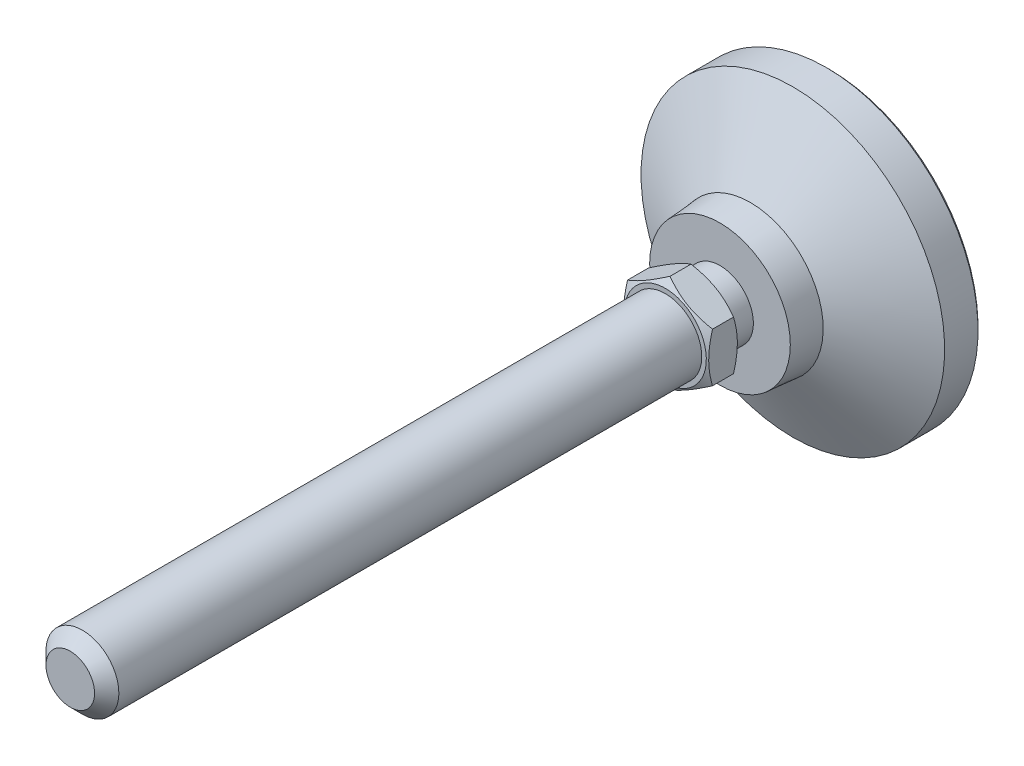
ISO-10303-21;
HEADER;
FILE_DESCRIPTION(('STEP AP214'),'2;1');
FILE_NAME('part.step','',(''),(''),'','','');
FILE_SCHEMA(('AUTOMOTIVE_DESIGN { 1 0 10303 214 1 1 1 1 }'));
ENDSEC;
DATA;
#1=APPLICATION_CONTEXT('core data for automotive mechanical design processes');
#2=APPLICATION_PROTOCOL_DEFINITION('international standard','automotive_design',2000,#1);
#3=PRODUCT_CONTEXT('',#1,'mechanical');
#4=PRODUCT('Part','Part','',(#3));
#5=PRODUCT_RELATED_PRODUCT_CATEGORY('part','',(#4));
#6=PRODUCT_DEFINITION_FORMATION('','',#4);
#7=PRODUCT_DEFINITION_CONTEXT('part definition',#1,'design');
#8=PRODUCT_DEFINITION('design','',#6,#7);
#9=PRODUCT_DEFINITION_SHAPE('','',#8);
#10=(LENGTH_UNIT() NAMED_UNIT(*) SI_UNIT(.MILLI.,.METRE.));
#11=(NAMED_UNIT(*) PLANE_ANGLE_UNIT() SI_UNIT($,.RADIAN.));
#12=(NAMED_UNIT(*) SI_UNIT($,.STERADIAN.) SOLID_ANGLE_UNIT());
#13=UNCERTAINTY_MEASURE_WITH_UNIT(LENGTH_MEASURE(1.E-05),#10,'distance_accuracy_value','');
#14=(GEOMETRIC_REPRESENTATION_CONTEXT(3) GLOBAL_UNCERTAINTY_ASSIGNED_CONTEXT((#13)) GLOBAL_UNIT_ASSIGNED_CONTEXT((#10,
#11,#12)) REPRESENTATION_CONTEXT('',''));
#15=CARTESIAN_POINT('',(0.,0.,0.));
#16=DIRECTION('',(0.,0.,1.));
#17=DIRECTION('',(1.,0.,0.));
#18=AXIS2_PLACEMENT_3D('',#15,#16,#17);
#19=CARTESIAN_POINT('',(0.,0.,-1.00000000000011));
#20=DIRECTION('',(0.,0.,-1.));
#21=DIRECTION('',(0.,1.,0.));
#22=AXIS2_PLACEMENT_3D('',#19,#20,#21);
#23=CYLINDRICAL_SURFACE('',#22,5.5);
#24=CARTESIAN_POINT('',(0.,0.,21.9999999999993));
#25=DIRECTION('',(0.,0.,-1.));
#26=DIRECTION('',(0.,1.,0.));
#27=AXIS2_PLACEMENT_3D('',#24,#25,#26);
#28=CIRCLE('',#27,5.5);
#29=CARTESIAN_POINT('',(0.,5.5,21.9999999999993));
#30=VERTEX_POINT('',#29);
#31=EDGE_CURVE('E100',#30,#30,#28,.T.);
#32=ORIENTED_EDGE('',*,*,#31,.T.);
#33=EDGE_LOOP('',(#32));
#34=FACE_BOUND('',#33,.T.);
#35=CARTESIAN_POINT('',(0.,0.,18.));
#36=DIRECTION('',(0.,0.,-1.));
#37=DIRECTION('',(0.,1.,0.));
#38=AXIS2_PLACEMENT_3D('',#35,#36,#37);
#39=CIRCLE('',#38,5.5);
#40=CARTESIAN_POINT('',(0.,5.5,18.));
#41=VERTEX_POINT('',#40);
#42=EDGE_CURVE('E93',#41,#41,#39,.T.);
#43=ORIENTED_EDGE('',*,*,#42,.F.);
#44=EDGE_LOOP('',(#43));
#45=FACE_BOUND('',#44,.T.);
#46=ADVANCED_FACE('F14',(#34,#45),#23,.T.);
#47=CARTESIAN_POINT('',(-5.5,0.,21.9999999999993));
#48=DIRECTION('',(0.,0.,1.));
#49=DIRECTION('',(0.,-1.,0.));
#50=AXIS2_PLACEMENT_3D('',#47,#48,#49);
#51=PLANE('',#50);
#52=CARTESIAN_POINT('',(0.,0.,21.9999999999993));
#53=DIRECTION('',(0.,0.,1.));
#54=DIRECTION('',(0.,-1.,0.));
#55=AXIS2_PLACEMENT_3D('',#52,#53,#54);
#56=CIRCLE('',#55,6.75);
#57=CARTESIAN_POINT('',(0.,-6.75,21.9999999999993));
#58=VERTEX_POINT('',#57);
#59=EDGE_CURVE('E417',#58,#58,#56,.T.);
#60=ORIENTED_EDGE('',*,*,#59,.F.);
#61=EDGE_LOOP('',(#60));
#62=FACE_BOUND('',#61,.T.);
#63=ORIENTED_EDGE('',*,*,#31,.F.);
#64=EDGE_LOOP('',(#63));
#65=FACE_BOUND('',#64,.T.);
#66=ADVANCED_FACE('F133',(#62,#65),#51,.F.);
#67=CARTESIAN_POINT('',(0.,-5.5,18.));
#68=DIRECTION('',(0.,0.,1.));
#69=DIRECTION('',(0.,-1.,0.));
#70=AXIS2_PLACEMENT_3D('',#67,#68,#69);
#71=PLANE('',#70);
#72=ORIENTED_EDGE('',*,*,#42,.T.);
#73=EDGE_LOOP('',(#72));
#74=FACE_BOUND('',#73,.T.);
#75=CARTESIAN_POINT('',(0.,0.,18.));
#76=DIRECTION('',(0.,0.,1.));
#77=DIRECTION('',(0.,-1.,0.));
#78=AXIS2_PLACEMENT_3D('',#75,#76,#77);
#79=CIRCLE('',#78,11.5833333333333);
#80=CARTESIAN_POINT('',(0.,-11.5833333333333,18.));
#81=VERTEX_POINT('',#80);
#82=EDGE_CURVE('E88',#81,#81,#79,.T.);
#83=ORIENTED_EDGE('',*,*,#82,.T.);
#84=EDGE_LOOP('',(#83));
#85=FACE_BOUND('',#84,.T.);
#86=ADVANCED_FACE('F124',(#74,#85),#71,.T.);
#87=CARTESIAN_POINT('',(0.,0.,0.));
#88=DIRECTION('',(0.,0.,-1.));
#89=DIRECTION('',(0.,1.,0.));
#90=AXIS2_PLACEMENT_3D('',#87,#88,#89);
#91=PLANE('',#90);
#92=CARTESIAN_POINT('',(0.,0.,0.));
#93=DIRECTION('',(0.,0.,-1.));
#94=DIRECTION('',(0.,1.,0.));
#95=AXIS2_PLACEMENT_3D('',#92,#93,#94);
#96=CIRCLE('',#95,24.5);
#97=CARTESIAN_POINT('',(0.,24.5,0.));
#98=VERTEX_POINT('',#97);
#99=EDGE_CURVE('E108',#98,#98,#96,.T.);
#100=ORIENTED_EDGE('',*,*,#99,.T.);
#101=EDGE_LOOP('',(#100));
#102=FACE_BOUND('',#101,.T.);
#103=ADVANCED_FACE('F122',(#102),#91,.T.);
#104=CARTESIAN_POINT('',(0.,0.,-1.00000000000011));
#105=DIRECTION('',(0.,0.,-1.));
#106=DIRECTION('',(0.,1.,0.));
#107=AXIS2_PLACEMENT_3D('',#104,#105,#106);
#108=CYLINDRICAL_SURFACE('',#107,25.);
#109=CARTESIAN_POINT('',(0.,0.,0.500000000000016));
#110=DIRECTION('',(0.,0.,-1.));
#111=DIRECTION('',(0.,1.,0.));
#112=AXIS2_PLACEMENT_3D('',#109,#110,#111);
#113=CIRCLE('',#112,25.);
#114=CARTESIAN_POINT('',(0.,25.,0.500000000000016));
#115=VERTEX_POINT('',#114);
#116=EDGE_CURVE('E28',#115,#115,#113,.F.);
#117=ORIENTED_EDGE('',*,*,#116,.T.);
#118=EDGE_LOOP('',(#117));
#119=FACE_BOUND('',#118,.T.);
#120=CARTESIAN_POINT('',(0.,0.,6.));
#121=DIRECTION('',(0.,0.,-1.));
#122=DIRECTION('',(0.,1.,0.));
#123=AXIS2_PLACEMENT_3D('',#120,#121,#122);
#124=CIRCLE('',#123,25.);
#125=CARTESIAN_POINT('',(0.,25.,6.));
#126=VERTEX_POINT('',#125);
#127=EDGE_CURVE('E106',#126,#126,#124,.T.);
#128=ORIENTED_EDGE('',*,*,#127,.T.);
#129=EDGE_LOOP('',(#128));
#130=FACE_BOUND('',#129,.T.);
#131=ADVANCED_FACE('F114',(#119,#130),#108,.T.);
#132=CARTESIAN_POINT('',(0.,0.,13.));
#133=DIRECTION('',(0.,0.,-1.));
#134=DIRECTION('',(0.,1.,0.));
#135=AXIS2_PLACEMENT_3D('',#132,#133,#134);
#136=CONICAL_SURFACE('',#135,11.9999999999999,1.07685495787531);
#137=ORIENTED_EDGE('',*,*,#127,.F.);
#138=EDGE_LOOP('',(#137));
#139=FACE_BOUND('',#138,.T.);
#140=CARTESIAN_POINT('',(0.,0.,13.));
#141=DIRECTION('',(0.,0.,-1.));
#142=DIRECTION('',(0.,1.,0.));
#143=AXIS2_PLACEMENT_3D('',#140,#141,#142);
#144=CIRCLE('',#143,11.9999999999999);
#145=CARTESIAN_POINT('',(0.,11.9999999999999,13.));
#146=VERTEX_POINT('',#145);
#147=EDGE_CURVE('E103',#146,#146,#144,.T.);
#148=ORIENTED_EDGE('',*,*,#147,.T.);
#149=EDGE_LOOP('',(#148));
#150=FACE_BOUND('',#149,.T.);
#151=ADVANCED_FACE('F132',(#139,#150),#136,.T.);
#152=CARTESIAN_POINT('',(0.,0.,19.));
#153=DIRECTION('',(0.,0.,-1.));
#154=DIRECTION('',(0.,1.,0.));
#155=AXIS2_PLACEMENT_3D('',#152,#153,#154);
#156=CONICAL_SURFACE('',#155,11.5,0.0831412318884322);
#157=ORIENTED_EDGE('',*,*,#147,.F.);
#158=EDGE_LOOP('',(#157));
#159=FACE_BOUND('',#158,.T.);
#160=ORIENTED_EDGE('',*,*,#82,.F.);
#161=EDGE_LOOP('',(#160));
#162=FACE_BOUND('',#161,.T.);
#163=ADVANCED_FACE('F119',(#159,#162),#156,.T.);
#164=CARTESIAN_POINT('',(0.,0.,0.));
#165=DIRECTION('',(0.,0.,1.));
#166=DIRECTION('',(0.,-1.,0.));
#167=AXIS2_PLACEMENT_3D('',#164,#165,#166);
#168=CONICAL_SURFACE('',#167,24.5,0.785398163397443);
#169=ORIENTED_EDGE('',*,*,#116,.F.);
#170=EDGE_LOOP('',(#169));
#171=FACE_BOUND('',#170,.T.);
#172=ORIENTED_EDGE('',*,*,#99,.F.);
#173=EDGE_LOOP('',(#172));
#174=FACE_BOUND('',#173,.T.);
#175=ADVANCED_FACE('F16',(#171,#174),#168,.T.);
#176=CARTESIAN_POINT('',(0.,0.,21.9999999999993));
#177=DIRECTION('',(0.,0.,1.));
#178=DIRECTION('',(0.,-1.,0.));
#179=AXIS2_PLACEMENT_3D('',#176,#177,#178);
#180=CONICAL_SURFACE('',#179,6.75,1.0471975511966);
#181=CARTESIAN_POINT('',(0.000200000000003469,-8.0830192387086,22.7696190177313));
#182=CARTESIAN_POINT('',(-0.15366790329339,-7.99418356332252,22.7183374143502));
#183=CARTESIAN_POINT('',(-0.308109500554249,-7.90501666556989,22.6693831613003));
#184=CARTESIAN_POINT('',(-0.618246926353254,-7.72595873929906,22.5767703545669));
#185=CARTESIAN_POINT('',(-0.773943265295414,-7.63606741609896,22.5331140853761));
#186=CARTESIAN_POINT('',(-1.24352516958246,-7.36495417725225,22.4109491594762));
#187=CARTESIAN_POINT('',(-1.5592643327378,-7.18266208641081,22.3414631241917));
#188=CARTESIAN_POINT('',(-2.03176224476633,-6.90986528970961,22.2599825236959));
#189=CARTESIAN_POINT('',(-2.18710922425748,-6.82017566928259,22.2367710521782));
#190=CARTESIAN_POINT('',(-2.49850511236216,-6.64039116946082,22.1978487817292));
#191=CARTESIAN_POINT('',(-2.6545539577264,-6.55029632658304,22.1821373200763));
#192=CARTESIAN_POINT('',(-2.96692267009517,-6.36995016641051,22.1586154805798));
#193=CARTESIAN_POINT('',(-3.12324202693,-6.27969914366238,22.1507961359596));
#194=CARTESIAN_POINT('',(-3.43601650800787,-6.09911871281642,22.1432178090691));
#195=CARTESIAN_POINT('',(-3.59247162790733,-6.00878930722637,22.1434585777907));
#196=CARTESIAN_POINT('',(-4.02110687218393,-5.76131663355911,22.1551972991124));
#197=CARTESIAN_POINT('',(-4.29314668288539,-5.60425437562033,22.1749033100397));
#198=CARTESIAN_POINT('',(-4.83541944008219,-5.29117305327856,22.2373910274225));
#199=CARTESIAN_POINT('',(-5.10565047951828,-5.13515508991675,22.2801940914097));
#200=CARTESIAN_POINT('',(-5.64901454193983,-4.82144370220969,22.3871892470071));
#201=CARTESIAN_POINT('',(-5.92207900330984,-4.6637898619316,22.4518346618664));
#202=CARTESIAN_POINT('',(-6.46413578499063,-4.35083323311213,22.5985536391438));
#203=CARTESIAN_POINT('',(-6.73313504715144,-4.19552643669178,22.6805927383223));
#204=CARTESIAN_POINT('',(-7.0002,-4.04133641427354,22.7696190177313));
#205=B_SPLINE_CURVE_WITH_KNOTS('',3,(#181,#182,#183,#184,#185,#186,#187,#188,#189,#190,#191,
#192,#193,#194,#195,#196,#197,#198,#199,#200,#201,#202,#203,#204),.UNSPECIFIED.,.F.,.F.,(4,2,2,
2,2,2,2,2,2,2,2,4),(0.,0.554727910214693,1.10969417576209,2.2219327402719,2.76443041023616,
3.30688013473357,3.84871284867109,4.39052882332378,5.33376515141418,6.27787517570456,
7.2429241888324,8.20607866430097),.UNSPECIFIED.);
#206=CARTESIAN_POINT('',(0.,-8.08290376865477,22.769552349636));
#207=VERTEX_POINT('',#206);
#208=CARTESIAN_POINT('',(-7.,-4.04145188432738,22.769552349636));
#209=VERTEX_POINT('',#208);
#210=EDGE_CURVE('E73',#207,#209,#205,.T.);
#211=ORIENTED_EDGE('',*,*,#210,.T.);
#212=CARTESIAN_POINT('',(-7.,10.8843135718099,25.5743487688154));
#213=CARTESIAN_POINT('',(-7.,10.5783368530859,25.4258083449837));
#214=CARTESIAN_POINT('',(-7.,10.2716608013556,25.2786839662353));
#215=CARTESIAN_POINT('',(-7.,9.65653822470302,24.9880631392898));
#216=CARTESIAN_POINT('',(-7.,9.34809143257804,24.8445672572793));
#217=CARTESIAN_POINT('',(-7.,8.72748000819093,24.561283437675));
#218=CARTESIAN_POINT('',(-7.,8.41530429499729,24.4215196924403));
#219=CARTESIAN_POINT('',(-7.,7.78847993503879,24.1476738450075));
#220=CARTESIAN_POINT('',(-7.,7.47383140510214,24.0135914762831));
#221=CARTESIAN_POINT('',(-7.,6.83129639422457,23.7483705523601));
#222=CARTESIAN_POINT('',(-7.,6.50331166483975,23.6174687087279));
#223=CARTESIAN_POINT('',(-7.,5.8435163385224,23.3655033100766));
#224=CARTESIAN_POINT('',(-7.,5.51170531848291,23.2444408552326));
#225=CARTESIAN_POINT('',(-7.,4.84433738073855,23.0153118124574));
#226=CARTESIAN_POINT('',(-7.,4.50878950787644,22.9072191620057));
#227=CARTESIAN_POINT('',(-7.,3.83289244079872,22.7074780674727));
#228=CARTESIAN_POINT('',(-7.,3.49254478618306,22.6158244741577));
#229=CARTESIAN_POINT('',(-7.,2.80869285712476,22.453835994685));
#230=CARTESIAN_POINT('',(-7.,2.46521697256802,22.3833844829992));
#231=CARTESIAN_POINT('',(-7.,1.9468522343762,22.2966442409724));
#232=CARTESIAN_POINT('',(-7.,1.77352613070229,22.2708858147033));
#233=CARTESIAN_POINT('',(-7.,1.42600353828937,22.2261860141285));
#234=CARTESIAN_POINT('',(-7.,1.25180713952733,22.2072439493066));
#235=CARTESIAN_POINT('',(-7.,0.905064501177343,22.1767931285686));
#236=CARTESIAN_POINT('',(-7.,0.732526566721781,22.165190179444));
#237=CARTESIAN_POINT('',(-7.,0.387114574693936,22.149292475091));
#238=CARTESIAN_POINT('',(-7.,0.214240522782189,22.1449975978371));
#239=CARTESIAN_POINT('',(-7.,-0.131534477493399,22.1438185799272));
#240=CARTESIAN_POINT('',(-7.,-0.304435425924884,22.1469344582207));
#241=CARTESIAN_POINT('',(-7.,-0.649951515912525,22.160500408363));
#242=CARTESIAN_POINT('',(-7.,-0.822566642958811,22.1709508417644));
#243=CARTESIAN_POINT('',(-7.,-1.23654690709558,22.2045874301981));
#244=CARTESIAN_POINT('',(-7.,-1.47763916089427,22.2312054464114));
#245=CARTESIAN_POINT('',(-7.,-1.95804167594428,22.2973039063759));
#246=CARTESIAN_POINT('',(-7.,-2.19735169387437,22.3367860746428));
#247=CARTESIAN_POINT('',(-7.,-2.91233041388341,22.4724359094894));
#248=CARTESIAN_POINT('',(-7.,-3.38478335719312,22.5857825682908));
#249=CARTESIAN_POINT('',(-7.,-4.09127056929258,22.7824373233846));
#250=CARTESIAN_POINT('',(-7.,-4.32896651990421,22.8533481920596));
#251=CARTESIAN_POINT('',(-7.,-4.80204998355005,23.0025606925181));
#252=CARTESIAN_POINT('',(-7.,-5.0374374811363,23.080862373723));
#253=CARTESIAN_POINT('',(-7.,-5.50597763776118,23.2435980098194));
#254=CARTESIAN_POINT('',(-7.,-5.73913099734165,23.3280299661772));
#255=CARTESIAN_POINT('',(-7.,-6.20350413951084,23.5020301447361));
#256=CARTESIAN_POINT('',(-7.,-6.43472394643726,23.5915983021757));
#257=CARTESIAN_POINT('',(-7.,-6.98705353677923,23.8114891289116));
#258=CARTESIAN_POINT('',(-7.,-7.30734827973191,23.9438554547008));
#259=CARTESIAN_POINT('',(-7.,-7.94515802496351,24.2151434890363));
#260=CARTESIAN_POINT('',(-7.,-8.26267284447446,24.3540656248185));
#261=CARTESIAN_POINT('',(-7.,-8.8954514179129,24.6371301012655));
#262=CARTESIAN_POINT('',(-7.,-9.2107146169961,24.7812736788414));
#263=CARTESIAN_POINT('',(-7.,-9.839297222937,25.0737095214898));
#264=CARTESIAN_POINT('',(-7.,-10.1526166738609,25.2220016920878));
#265=CARTESIAN_POINT('',(-7.,-10.7779976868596,25.5221168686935));
#266=CARTESIAN_POINT('',(-7.,-11.0900574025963,25.6739437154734));
#267=CARTESIAN_POINT('',(-7.,-11.7128200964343,25.9803574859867));
#268=CARTESIAN_POINT('',(-7.,-12.0235230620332,26.1349444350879));
#269=CARTESIAN_POINT('',(-7.,-12.9538381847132,26.6020567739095));
#270=CARTESIAN_POINT('',(-7.,-13.5717456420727,26.9179767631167));
#271=CARTESIAN_POINT('',(-7.,-14.7513150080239,27.5287296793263));
#272=CARTESIAN_POINT('',(-7.,-15.3132476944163,27.8230420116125));
#273=CARTESIAN_POINT('',(-7.,-16.4350354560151,28.4156479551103));
#274=CARTESIAN_POINT('',(-7.,-16.9948904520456,28.7139417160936));
#275=CARTESIAN_POINT('',(-7.,-18.1115346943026,29.3127759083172));
#276=CARTESIAN_POINT('',(-7.,-18.6683281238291,29.613308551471));
#277=CARTESIAN_POINT('',(-7.,-19.7805907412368,30.21673960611));
#278=CARTESIAN_POINT('',(-7.,-20.3360600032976,30.5196378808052));
#279=CARTESIAN_POINT('',(-7.,-20.8910440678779,30.8234166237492));
#280=B_SPLINE_CURVE_WITH_KNOTS('',3,(#212,#213,#214,#215,#216,#217,#218,#219,#220,#221,#222,
#223,#224,#225,#226,#227,#228,#229,#230,#231,#232,#233,#234,#235,#236,#237,#238,#239,#240,#241,
#242,#243,#244,#245,#246,#247,#248,#249,#250,#251,#252,#253,#254,#255,#256,#257,#258,#259,#260,
#261,#262,#263,#264,#265,#266,#267,#268,#269,#270,#271,#272,#273,#274,#275,#276,#277,#278,#279),
.UNSPECIFIED.,.F.,.F.,(4,2,2,2,2,2,2,2,2,2,2,2,2,2,2,2,2,2,2,2,2,2,2,2,2,2,2,2,2,2,2,2,2,4),(0.,
1.02039170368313,2.04094165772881,3.06699969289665,4.09300953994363,5.15231303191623,
6.21173480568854,7.26899071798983,8.32591488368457,9.37691428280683,9.90249034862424,
10.4280131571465,10.9466465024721,11.4652711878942,11.9838971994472,12.502548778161,
13.2298100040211,13.9571687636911,15.4126793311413,16.1567601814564,16.9008460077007,
17.6446903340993,18.3885252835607,19.4281306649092,20.4678038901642,21.5077250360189,
22.547622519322,23.5887082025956,24.6298034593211,26.7116971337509,28.6147022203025,
30.5177790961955,32.4159429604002,34.3139978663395),.UNSPECIFIED.);
#281=CARTESIAN_POINT('',(-7.,4.04145188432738,22.769552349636));
#282=VERTEX_POINT('',#281);
#283=EDGE_CURVE('E81',#209,#282,#280,.F.);
#284=ORIENTED_EDGE('',*,*,#283,.T.);
#285=CARTESIAN_POINT('',(-7.0002,4.04133641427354,22.7696190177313));
#286=CARTESIAN_POINT('',(-6.84633209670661,4.13017208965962,22.7183374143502));
#287=CARTESIAN_POINT('',(-6.69189049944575,4.21933898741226,22.6693831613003));
#288=CARTESIAN_POINT('',(-6.38175307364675,4.39839691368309,22.5767703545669));
#289=CARTESIAN_POINT('',(-6.22605673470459,4.48828823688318,22.5331140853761));
#290=CARTESIAN_POINT('',(-5.75647483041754,4.75940147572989,22.4109491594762));
#291=CARTESIAN_POINT('',(-5.4407356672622,4.94169356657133,22.3414631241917));
#292=CARTESIAN_POINT('',(-4.96823775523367,5.21449036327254,22.2599825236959));
#293=CARTESIAN_POINT('',(-4.81289077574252,5.30417998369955,22.2367710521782));
#294=CARTESIAN_POINT('',(-4.50149488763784,5.48396448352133,22.1978487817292));
#295=CARTESIAN_POINT('',(-4.3454460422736,5.57405932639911,22.1821373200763));
#296=CARTESIAN_POINT('',(-4.03307732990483,5.75440548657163,22.1586154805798));
#297=CARTESIAN_POINT('',(-3.87675797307,5.84465650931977,22.1507961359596));
#298=CARTESIAN_POINT('',(-3.56398349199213,6.02523694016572,22.1432178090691));
#299=CARTESIAN_POINT('',(-3.40752837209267,6.11556634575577,22.1434585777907));
#300=CARTESIAN_POINT('',(-2.97889312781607,6.36303901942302,22.1551972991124));
#301=CARTESIAN_POINT('',(-2.70685331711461,6.52010127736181,22.1749033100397));
#302=CARTESIAN_POINT('',(-2.16458055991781,6.83318259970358,22.2373910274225));
#303=CARTESIAN_POINT('',(-1.89434952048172,6.9892005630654,22.2801940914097));
#304=CARTESIAN_POINT('',(-1.35098545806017,7.30291195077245,22.3871892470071));
#305=CARTESIAN_POINT('',(-1.07792099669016,7.46056579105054,22.4518346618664));
#306=CARTESIAN_POINT('',(-0.535864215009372,7.77352241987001,22.5985536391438));
#307=CARTESIAN_POINT('',(-0.266864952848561,7.92882921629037,22.6805927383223));
#308=CARTESIAN_POINT('',(0.00019999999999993,8.0830192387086,22.7696190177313));
#309=B_SPLINE_CURVE_WITH_KNOTS('',3,(#285,#286,#287,#288,#289,#290,#291,#292,#293,#294,#295,
#296,#297,#298,#299,#300,#301,#302,#303,#304,#305,#306,#307,#308),.UNSPECIFIED.,.F.,.F.,(4,2,2,
2,2,2,2,2,2,2,2,4),(0.,0.554727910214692,1.10969417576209,2.22193274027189,2.76443041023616,
3.30688013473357,3.84871284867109,4.39052882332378,5.33376515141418,6.27787517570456,
7.2429241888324,8.20607866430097),.UNSPECIFIED.);
#310=CARTESIAN_POINT('',(0.,8.08290376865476,22.769552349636));
#311=VERTEX_POINT('',#310);
#312=EDGE_CURVE('E361',#282,#311,#309,.T.);
#313=ORIENTED_EDGE('',*,*,#312,.T.);
#314=CARTESIAN_POINT('',(-0.000200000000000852,8.0830192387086,22.7696190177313));
#315=CARTESIAN_POINT('',(0.15366790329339,7.99418356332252,22.7183374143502));
#316=CARTESIAN_POINT('',(0.308109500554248,7.90501666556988,22.6693831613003));
#317=CARTESIAN_POINT('',(0.618246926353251,7.72595873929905,22.5767703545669));
#318=CARTESIAN_POINT('',(0.773943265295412,7.63606741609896,22.5331140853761));
#319=CARTESIAN_POINT('',(1.24352516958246,7.36495417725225,22.4109491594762));
#320=CARTESIAN_POINT('',(1.5592643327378,7.18266208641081,22.3414631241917));
#321=CARTESIAN_POINT('',(2.03176224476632,6.9098652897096,22.2599825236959));
#322=CARTESIAN_POINT('',(2.18710922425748,6.82017566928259,22.2367710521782));
#323=CARTESIAN_POINT('',(2.49850511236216,6.64039116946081,22.1978487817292));
#324=CARTESIAN_POINT('',(2.6545539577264,6.55029632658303,22.1821373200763));
#325=CARTESIAN_POINT('',(2.96692267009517,6.36995016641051,22.1586154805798));
#326=CARTESIAN_POINT('',(3.12324202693,6.27969914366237,22.1507961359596));
#327=CARTESIAN_POINT('',(3.43601650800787,6.09911871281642,22.1432178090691));
#328=CARTESIAN_POINT('',(3.59247162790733,6.00878930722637,22.1434585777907));
#329=CARTESIAN_POINT('',(4.02110687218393,5.76131663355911,22.1551972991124));
#330=CARTESIAN_POINT('',(4.29314668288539,5.60425437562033,22.1749033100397));
#331=CARTESIAN_POINT('',(4.83541944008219,5.29117305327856,22.2373910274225));
#332=CARTESIAN_POINT('',(5.10565047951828,5.13515508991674,22.2801940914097));
#333=CARTESIAN_POINT('',(5.64901454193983,4.82144370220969,22.3871892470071));
#334=CARTESIAN_POINT('',(5.92207900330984,4.66378986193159,22.4518346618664));
#335=CARTESIAN_POINT('',(6.46413578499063,4.35083323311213,22.5985536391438));
#336=CARTESIAN_POINT('',(6.73313504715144,4.19552643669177,22.6805927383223));
#337=CARTESIAN_POINT('',(7.0002,4.04133641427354,22.7696190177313));
#338=B_SPLINE_CURVE_WITH_KNOTS('',3,(#314,#315,#316,#317,#318,#319,#320,#321,#322,#323,#324,
#325,#326,#327,#328,#329,#330,#331,#332,#333,#334,#335,#336,#337),.UNSPECIFIED.,.F.,.F.,(4,2,2,
2,2,2,2,2,2,2,2,4),(0.,0.554727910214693,1.10969417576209,2.2219327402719,2.76443041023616,
3.30688013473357,3.84871284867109,4.39052882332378,5.33376515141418,6.27787517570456,
7.2429241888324,8.20607866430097),.UNSPECIFIED.);
#339=CARTESIAN_POINT('',(7.,4.04145188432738,22.769552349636));
#340=VERTEX_POINT('',#339);
#341=EDGE_CURVE('E356',#311,#340,#338,.T.);
#342=ORIENTED_EDGE('',*,*,#341,.T.);
#343=CARTESIAN_POINT('',(7.,10.8843135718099,25.5743487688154));
#344=CARTESIAN_POINT('',(7.,10.5783368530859,25.4258083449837));
#345=CARTESIAN_POINT('',(7.,10.2716608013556,25.2786839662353));
#346=CARTESIAN_POINT('',(7.,9.65653822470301,24.9880631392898));
#347=CARTESIAN_POINT('',(7.,9.34809143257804,24.8445672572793));
#348=CARTESIAN_POINT('',(7.,8.72748000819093,24.561283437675));
#349=CARTESIAN_POINT('',(7.,8.41530429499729,24.4215196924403));
#350=CARTESIAN_POINT('',(7.,7.78847993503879,24.1476738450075));
#351=CARTESIAN_POINT('',(7.,7.47383140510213,24.0135914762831));
#352=CARTESIAN_POINT('',(7.,6.83129639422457,23.7483705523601));
#353=CARTESIAN_POINT('',(7.,6.50331166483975,23.6174687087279));
#354=CARTESIAN_POINT('',(7.,5.8435163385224,23.3655033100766));
#355=CARTESIAN_POINT('',(7.,5.51170531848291,23.2444408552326));
#356=CARTESIAN_POINT('',(7.,4.84433738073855,23.0153118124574));
#357=CARTESIAN_POINT('',(7.,4.50878950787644,22.9072191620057));
#358=CARTESIAN_POINT('',(7.,3.83289244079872,22.7074780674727));
#359=CARTESIAN_POINT('',(7.,3.49254478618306,22.6158244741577));
#360=CARTESIAN_POINT('',(7.,2.80869285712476,22.453835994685));
#361=CARTESIAN_POINT('',(7.,2.46521697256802,22.3833844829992));
#362=CARTESIAN_POINT('',(7.,1.9468522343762,22.2966442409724));
#363=CARTESIAN_POINT('',(7.,1.77352613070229,22.2708858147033));
#364=CARTESIAN_POINT('',(7.,1.42600353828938,22.2261860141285));
#365=CARTESIAN_POINT('',(7.,1.25180713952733,22.2072439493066));
#366=CARTESIAN_POINT('',(7.,0.905064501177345,22.1767931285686));
#367=CARTESIAN_POINT('',(7.,0.732526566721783,22.165190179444));
#368=CARTESIAN_POINT('',(7.,0.387114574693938,22.149292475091));
#369=CARTESIAN_POINT('',(7.,0.214240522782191,22.1449975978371));
#370=CARTESIAN_POINT('',(7.,-0.131534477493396,22.1438185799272));
#371=CARTESIAN_POINT('',(7.,-0.30443542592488,22.1469344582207));
#372=CARTESIAN_POINT('',(7.,-0.649951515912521,22.160500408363));
#373=CARTESIAN_POINT('',(7.,-0.822566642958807,22.1709508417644));
#374=CARTESIAN_POINT('',(7.,-1.23654690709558,22.2045874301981));
#375=CARTESIAN_POINT('',(7.,-1.47763916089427,22.2312054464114));
#376=CARTESIAN_POINT('',(7.,-1.95804167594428,22.2973039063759));
#377=CARTESIAN_POINT('',(7.,-2.19735169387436,22.3367860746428));
#378=CARTESIAN_POINT('',(7.,-2.91233041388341,22.4724359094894));
#379=CARTESIAN_POINT('',(7.,-3.38478335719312,22.5857825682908));
#380=CARTESIAN_POINT('',(7.,-4.09127056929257,22.7824373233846));
#381=CARTESIAN_POINT('',(7.,-4.3289665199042,22.8533481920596));
#382=CARTESIAN_POINT('',(7.,-4.80204998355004,23.0025606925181));
#383=CARTESIAN_POINT('',(7.,-5.03743748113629,23.080862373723));
#384=CARTESIAN_POINT('',(7.,-5.50597763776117,23.2435980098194));
#385=CARTESIAN_POINT('',(7.,-5.73913099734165,23.3280299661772));
#386=CARTESIAN_POINT('',(7.,-6.20350413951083,23.5020301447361));
#387=CARTESIAN_POINT('',(7.,-6.43472394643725,23.5915983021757));
#388=CARTESIAN_POINT('',(7.,-6.98705353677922,23.8114891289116));
#389=CARTESIAN_POINT('',(7.,-7.3073482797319,23.9438554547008));
#390=CARTESIAN_POINT('',(7.,-7.9451580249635,24.2151434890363));
#391=CARTESIAN_POINT('',(7.,-8.26267284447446,24.3540656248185));
#392=CARTESIAN_POINT('',(7.,-8.89545141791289,24.6371301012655));
#393=CARTESIAN_POINT('',(7.,-9.21071461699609,24.7812736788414));
#394=CARTESIAN_POINT('',(7.,-9.83929722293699,25.0737095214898));
#395=CARTESIAN_POINT('',(7.,-10.1526166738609,25.2220016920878));
#396=CARTESIAN_POINT('',(7.,-10.7779976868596,25.5221168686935));
#397=CARTESIAN_POINT('',(7.,-11.0900574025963,25.6739437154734));
#398=CARTESIAN_POINT('',(7.,-11.7128200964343,25.9803574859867));
#399=CARTESIAN_POINT('',(7.,-12.0235230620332,26.1349444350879));
#400=CARTESIAN_POINT('',(7.,-12.9538381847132,26.6020567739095));
#401=CARTESIAN_POINT('',(7.,-13.5717456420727,26.9179767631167));
#402=CARTESIAN_POINT('',(7.,-14.7513150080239,27.5287296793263));
#403=CARTESIAN_POINT('',(7.,-15.3132476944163,27.8230420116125));
#404=CARTESIAN_POINT('',(7.,-16.4350354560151,28.4156479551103));
#405=CARTESIAN_POINT('',(7.,-16.9948904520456,28.7139417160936));
#406=CARTESIAN_POINT('',(7.,-18.1115346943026,29.3127759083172));
#407=CARTESIAN_POINT('',(7.,-18.6683281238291,29.613308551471));
#408=CARTESIAN_POINT('',(7.,-19.7805907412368,30.21673960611));
#409=CARTESIAN_POINT('',(7.,-20.3360600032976,30.5196378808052));
#410=CARTESIAN_POINT('',(7.,-20.8910440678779,30.8234166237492));
#411=B_SPLINE_CURVE_WITH_KNOTS('',3,(#343,#344,#345,#346,#347,#348,#349,#350,#351,#352,#353,
#354,#355,#356,#357,#358,#359,#360,#361,#362,#363,#364,#365,#366,#367,#368,#369,#370,#371,#372,
#373,#374,#375,#376,#377,#378,#379,#380,#381,#382,#383,#384,#385,#386,#387,#388,#389,#390,#391,
#392,#393,#394,#395,#396,#397,#398,#399,#400,#401,#402,#403,#404,#405,#406,#407,#408,#409,#410),
.UNSPECIFIED.,.F.,.F.,(4,2,2,2,2,2,2,2,2,2,2,2,2,2,2,2,2,2,2,2,2,2,2,2,2,2,2,2,2,2,2,2,2,4),(0.,
1.02039170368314,2.04094165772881,3.06699969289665,4.09300953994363,5.15231303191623,
6.21173480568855,7.26899071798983,8.32591488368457,9.37691428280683,9.90249034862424,
10.4280131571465,10.9466465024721,11.4652711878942,11.9838971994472,12.502548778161,
13.2298100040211,13.9571687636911,15.4126793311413,16.1567601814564,16.9008460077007,
17.6446903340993,18.3885252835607,19.4281306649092,20.4678038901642,21.5077250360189,
22.547622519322,23.5887082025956,24.6298034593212,26.7116971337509,28.6147022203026,
30.5177790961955,32.4159429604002,34.3139978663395),.UNSPECIFIED.);
#412=CARTESIAN_POINT('',(7.,-4.04145188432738,22.769552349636));
#413=VERTEX_POINT('',#412);
#414=EDGE_CURVE('E34',#340,#413,#411,.T.);
#415=ORIENTED_EDGE('',*,*,#414,.T.);
#416=CARTESIAN_POINT('',(7.0002,-4.04133641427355,22.7696190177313));
#417=CARTESIAN_POINT('',(6.84633209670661,-4.13017208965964,22.7183374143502));
#418=CARTESIAN_POINT('',(6.69189049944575,-4.21933898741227,22.6693831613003));
#419=CARTESIAN_POINT('',(6.38175307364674,-4.3983969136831,22.5767703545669));
#420=CARTESIAN_POINT('',(6.22605673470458,-4.4882882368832,22.5331140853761));
#421=CARTESIAN_POINT('',(5.75647483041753,-4.7594014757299,22.4109491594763));
#422=CARTESIAN_POINT('',(5.4407356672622,-4.94169356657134,22.3414631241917));
#423=CARTESIAN_POINT('',(4.96823775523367,-5.21449036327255,22.2599825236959));
#424=CARTESIAN_POINT('',(4.81289077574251,-5.30417998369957,22.2367710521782));
#425=CARTESIAN_POINT('',(4.50149488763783,-5.48396448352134,22.1978487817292));
#426=CARTESIAN_POINT('',(4.34544604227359,-5.57405932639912,22.1821373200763));
#427=CARTESIAN_POINT('',(4.03307732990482,-5.75440548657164,22.1586154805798));
#428=CARTESIAN_POINT('',(3.87675797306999,-5.84465650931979,22.1507961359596));
#429=CARTESIAN_POINT('',(3.56398349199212,-6.02523694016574,22.1432178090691));
#430=CARTESIAN_POINT('',(3.40752837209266,-6.11556634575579,22.1434585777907));
#431=CARTESIAN_POINT('',(2.97889312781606,-6.36303901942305,22.1551972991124));
#432=CARTESIAN_POINT('',(2.7068533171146,-6.52010127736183,22.1749033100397));
#433=CARTESIAN_POINT('',(2.1645805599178,-6.8331825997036,22.2373910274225));
#434=CARTESIAN_POINT('',(1.89434952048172,-6.98920056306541,22.2801940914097));
#435=CARTESIAN_POINT('',(1.35098545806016,-7.30291195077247,22.3871892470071));
#436=CARTESIAN_POINT('',(1.07792099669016,-7.46056579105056,22.4518346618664));
#437=CARTESIAN_POINT('',(0.535864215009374,-7.77352241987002,22.5985536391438));
#438=CARTESIAN_POINT('',(0.266864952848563,-7.92882921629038,22.6805927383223));
#439=CARTESIAN_POINT('',(-0.000199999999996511,-8.08301923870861,22.7696190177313));
#440=B_SPLINE_CURVE_WITH_KNOTS('',3,(#416,#417,#418,#419,#420,#421,#422,#423,#424,#425,#426,
#427,#428,#429,#430,#431,#432,#433,#434,#435,#436,#437,#438,#439),.UNSPECIFIED.,.F.,.F.,(4,2,2,
2,2,2,2,2,2,2,2,4),(0.,0.554727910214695,1.10969417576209,2.2219327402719,2.76443041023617,
3.30688013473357,3.8487128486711,4.39052882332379,5.33376515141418,6.27787517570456,
7.24292418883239,8.20607866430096),.UNSPECIFIED.);
#441=EDGE_CURVE('E9',#413,#207,#440,.T.);
#442=ORIENTED_EDGE('',*,*,#441,.T.);
#443=EDGE_LOOP('',(#211,#284,#313,#342,#415,#442));
#444=FACE_BOUND('',#443,.T.);
#445=ORIENTED_EDGE('',*,*,#59,.T.);
#446=EDGE_LOOP('',(#445));
#447=FACE_BOUND('',#446,.T.);
#448=ADVANCED_FACE('F71',(#444,#447),#180,.T.);
#449=CARTESIAN_POINT('',(0.,0.,125.));
#450=DIRECTION('',(0.,0.,-1.));
#451=DIRECTION('',(0.,1.,0.));
#452=AXIS2_PLACEMENT_3D('',#449,#450,#451);
#453=PLANE('',#452);
#454=CARTESIAN_POINT('',(0.,0.,125.));
#455=DIRECTION('',(0.,0.,-1.));
#456=DIRECTION('',(0.,1.,0.));
#457=AXIS2_PLACEMENT_3D('',#454,#455,#456);
#458=CIRCLE('',#457,3.99999999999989);
#459=CARTESIAN_POINT('',(0.,3.99999999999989,125.));
#460=VERTEX_POINT('',#459);
#461=EDGE_CURVE('E393',#460,#460,#458,.T.);
#462=ORIENTED_EDGE('',*,*,#461,.F.);
#463=EDGE_LOOP('',(#462));
#464=FACE_BOUND('',#463,.T.);
#465=ADVANCED_FACE('F187',(#464),#453,.F.);
#466=CARTESIAN_POINT('',(0.,0.,125.));
#467=DIRECTION('',(0.,0.,-1.));
#468=DIRECTION('',(0.,1.,0.));
#469=AXIS2_PLACEMENT_3D('',#466,#467,#468);
#470=CONICAL_SURFACE('',#469,3.99999999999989,0.785398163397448);
#471=CARTESIAN_POINT('',(0.,0.,123.));
#472=DIRECTION('',(0.,0.,-1.));
#473=DIRECTION('',(0.,1.,0.));
#474=AXIS2_PLACEMENT_3D('',#471,#472,#473);
#475=CIRCLE('',#474,5.99999999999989);
#476=CARTESIAN_POINT('',(0.,5.99999999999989,123.));
#477=VERTEX_POINT('',#476);
#478=EDGE_CURVE('E391',#477,#477,#475,.T.);
#479=ORIENTED_EDGE('',*,*,#478,.F.);
#480=EDGE_LOOP('',(#479));
#481=FACE_BOUND('',#480,.T.);
#482=ORIENTED_EDGE('',*,*,#461,.T.);
#483=EDGE_LOOP('',(#482));
#484=FACE_BOUND('',#483,.T.);
#485=ADVANCED_FACE('F194',(#481,#484),#470,.T.);
#486=CARTESIAN_POINT('',(0.,0.,-1.00000000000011));
#487=DIRECTION('',(0.,0.,-1.));
#488=DIRECTION('',(0.,1.,0.));
#489=AXIS2_PLACEMENT_3D('',#486,#487,#488);
#490=CYLINDRICAL_SURFACE('',#489,5.99999999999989);
#491=CARTESIAN_POINT('',(0.,0.,26.9999999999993));
#492=DIRECTION('',(0.,0.,-1.));
#493=DIRECTION('',(0.,1.,0.));
#494=AXIS2_PLACEMENT_3D('',#491,#492,#493);
#495=CIRCLE('',#494,5.99999999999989);
#496=CARTESIAN_POINT('',(0.,5.99999999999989,26.9999999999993));
#497=VERTEX_POINT('',#496);
#498=EDGE_CURVE('E97',#497,#497,#495,.T.);
#499=ORIENTED_EDGE('',*,*,#498,.F.);
#500=EDGE_LOOP('',(#499));
#501=FACE_BOUND('',#500,.T.);
#502=ORIENTED_EDGE('',*,*,#478,.T.);
#503=EDGE_LOOP('',(#502));
#504=FACE_BOUND('',#503,.T.);
#505=ADVANCED_FACE('F203',(#501,#504),#490,.T.);
#506=CARTESIAN_POINT('',(-5.99999999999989,0.,26.9999999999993));
#507=DIRECTION('',(0.,0.,-1.));
#508=DIRECTION('',(0.,1.,0.));
#509=AXIS2_PLACEMENT_3D('',#506,#507,#508);
#510=PLANE('',#509);
#511=CARTESIAN_POINT('',(0.,0.,26.9999999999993));
#512=DIRECTION('',(0.,0.,1.));
#513=DIRECTION('',(0.,-1.,0.));
#514=AXIS2_PLACEMENT_3D('',#511,#512,#513);
#515=CIRCLE('',#514,6.75);
#516=CARTESIAN_POINT('',(0.,-6.75,26.9999999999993));
#517=VERTEX_POINT('',#516);
#518=EDGE_CURVE('E80',#517,#517,#515,.T.);
#519=ORIENTED_EDGE('',*,*,#518,.T.);
#520=EDGE_LOOP('',(#519));
#521=FACE_BOUND('',#520,.T.);
#522=ORIENTED_EDGE('',*,*,#498,.T.);
#523=EDGE_LOOP('',(#522));
#524=FACE_BOUND('',#523,.T.);
#525=ADVANCED_FACE('F212',(#521,#524),#510,.F.);
#526=CARTESIAN_POINT('',(0.,0.,24.897177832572));
#527=DIRECTION('',(0.,0.,-1.));
#528=DIRECTION('',(0.,1.,0.));
#529=AXIS2_PLACEMENT_3D('',#526,#527,#528);
#530=CONICAL_SURFACE('',#529,10.3921948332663,1.0471975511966);
#531=CARTESIAN_POINT('',(-7.0002,-4.04133641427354,26.2303809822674));
#532=CARTESIAN_POINT('',(-6.84633209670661,-4.13017208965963,26.2816625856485));
#533=CARTESIAN_POINT('',(-6.69189049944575,-4.21933898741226,26.3306168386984));
#534=CARTESIAN_POINT('',(-6.38175307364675,-4.39839691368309,26.4232296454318));
#535=CARTESIAN_POINT('',(-6.22605673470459,-4.48828823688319,26.4668859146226));
#536=CARTESIAN_POINT('',(-5.75647483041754,-4.75940147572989,26.5890508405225));
#537=CARTESIAN_POINT('',(-5.4407356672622,-4.94169356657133,26.658536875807));
#538=CARTESIAN_POINT('',(-4.96823775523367,-5.21449036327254,26.7400174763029));
#539=CARTESIAN_POINT('',(-4.81289077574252,-5.30417998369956,26.7632289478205));
#540=CARTESIAN_POINT('',(-4.50149488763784,-5.48396448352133,26.8021512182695));
#541=CARTESIAN_POINT('',(-4.3454460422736,-5.57405932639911,26.8178626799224));
#542=CARTESIAN_POINT('',(-4.03307732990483,-5.75440548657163,26.8413845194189));
#543=CARTESIAN_POINT('',(-3.87675797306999,-5.84465650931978,26.8492038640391));
#544=CARTESIAN_POINT('',(-3.56398349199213,-6.02523694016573,26.8567821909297));
#545=CARTESIAN_POINT('',(-3.40752837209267,-6.11556634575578,26.856541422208));
#546=CARTESIAN_POINT('',(-2.97889312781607,-6.36303901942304,26.8448027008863));
#547=CARTESIAN_POINT('',(-2.7068533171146,-6.52010127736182,26.825096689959));
#548=CARTESIAN_POINT('',(-2.1645805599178,-6.83318259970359,26.7626089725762));
#549=CARTESIAN_POINT('',(-1.89434952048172,-6.98920056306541,26.719805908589));
#550=CARTESIAN_POINT('',(-1.35098545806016,-7.30291195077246,26.6128107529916));
#551=CARTESIAN_POINT('',(-1.07792099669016,-7.46056579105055,26.5481653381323));
#552=CARTESIAN_POINT('',(-0.535864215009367,-7.77352241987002,26.4014463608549));
#553=CARTESIAN_POINT('',(-0.266864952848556,-7.92882921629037,26.3194072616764));
#554=CARTESIAN_POINT('',(0.000200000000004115,-8.0830192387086,26.2303809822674));
#555=B_SPLINE_CURVE_WITH_KNOTS('',3,(#531,#532,#533,#534,#535,#536,#537,#538,#539,#540,#541,
#542,#543,#544,#545,#546,#547,#548,#549,#550,#551,#552,#553,#554),.UNSPECIFIED.,.F.,.F.,(4,2,2,
2,2,2,2,2,2,2,2,4),(0.,0.554727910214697,1.10969417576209,2.2219327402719,2.76443041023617,
3.30688013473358,3.8487128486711,4.3905288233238,5.33376515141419,6.27787517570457,
7.24292418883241,8.20607866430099),.UNSPECIFIED.);
#556=CARTESIAN_POINT('',(-7.,-4.04145188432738,26.2304476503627));
#557=VERTEX_POINT('',#556);
#558=CARTESIAN_POINT('',(0.,-8.08290376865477,26.2304476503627));
#559=VERTEX_POINT('',#558);
#560=EDGE_CURVE('E323',#557,#559,#555,.T.);
#561=ORIENTED_EDGE('',*,*,#560,.T.);
#562=CARTESIAN_POINT('',(-0.000199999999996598,-8.08301923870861,26.2303809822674));
#563=CARTESIAN_POINT('',(0.153667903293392,-7.99418356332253,26.2816625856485));
#564=CARTESIAN_POINT('',(0.30810950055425,-7.9050166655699,26.3306168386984));
#565=CARTESIAN_POINT('',(0.618246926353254,-7.72595873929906,26.4232296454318));
#566=CARTESIAN_POINT('',(0.773943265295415,-7.63606741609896,26.4668859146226));
#567=CARTESIAN_POINT('',(1.24352516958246,-7.36495417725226,26.5890508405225));
#568=CARTESIAN_POINT('',(1.5592643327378,-7.18266208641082,26.658536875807));
#569=CARTESIAN_POINT('',(2.03176224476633,-6.90986528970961,26.7400174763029));
#570=CARTESIAN_POINT('',(2.18710922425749,-6.8201756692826,26.7632289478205));
#571=CARTESIAN_POINT('',(2.49850511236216,-6.64039116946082,26.8021512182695));
#572=CARTESIAN_POINT('',(2.65455395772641,-6.55029632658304,26.8178626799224));
#573=CARTESIAN_POINT('',(2.96692267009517,-6.36995016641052,26.8413845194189));
#574=CARTESIAN_POINT('',(3.12324202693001,-6.27969914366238,26.8492038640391));
#575=CARTESIAN_POINT('',(3.43601650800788,-6.09911871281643,26.8567821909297));
#576=CARTESIAN_POINT('',(3.59247162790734,-6.00878930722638,26.856541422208));
#577=CARTESIAN_POINT('',(4.02110687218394,-5.76131663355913,26.8448027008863));
#578=CARTESIAN_POINT('',(4.2931466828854,-5.60425437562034,26.825096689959));
#579=CARTESIAN_POINT('',(4.8354194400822,-5.29117305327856,26.7626089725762));
#580=CARTESIAN_POINT('',(5.10565047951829,-5.13515508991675,26.719805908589));
#581=CARTESIAN_POINT('',(5.64901454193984,-4.8214437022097,26.6128107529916));
#582=CARTESIAN_POINT('',(5.92207900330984,-4.6637898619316,26.5481653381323));
#583=CARTESIAN_POINT('',(6.46413578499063,-4.35083323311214,26.4014463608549));
#584=CARTESIAN_POINT('',(6.73313504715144,-4.19552643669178,26.3194072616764));
#585=CARTESIAN_POINT('',(7.0002,-4.04133641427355,26.2303809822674));
#586=B_SPLINE_CURVE_WITH_KNOTS('',3,(#562,#563,#564,#565,#566,#567,#568,#569,#570,#571,#572,
#573,#574,#575,#576,#577,#578,#579,#580,#581,#582,#583,#584,#585),.UNSPECIFIED.,.F.,.F.,(4,2,2,
2,2,2,2,2,2,2,2,4),(0.,0.554727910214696,1.10969417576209,2.2219327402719,2.76443041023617,
3.30688013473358,3.8487128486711,4.39052882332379,5.33376515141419,6.27787517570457,
7.2429241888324,8.20607866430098),.UNSPECIFIED.);
#587=CARTESIAN_POINT('',(7.,-4.04145188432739,26.2304476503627));
#588=VERTEX_POINT('',#587);
#589=EDGE_CURVE('E86',#559,#588,#586,.T.);
#590=ORIENTED_EDGE('',*,*,#589,.T.);
#591=CARTESIAN_POINT('',(7.,10.8843135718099,23.4256512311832));
#592=CARTESIAN_POINT('',(7.,10.5783368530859,23.574191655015));
#593=CARTESIAN_POINT('',(7.,10.2716608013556,23.7213160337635));
#594=CARTESIAN_POINT('',(7.,9.65653822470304,24.011936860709));
#595=CARTESIAN_POINT('',(7.,9.34809143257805,24.1554327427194));
#596=CARTESIAN_POINT('',(7.,8.72748000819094,24.4387165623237));
#597=CARTESIAN_POINT('',(7.,8.4153042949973,24.5784803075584));
#598=CARTESIAN_POINT('',(7.,7.7884799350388,24.8523261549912));
#599=CARTESIAN_POINT('',(7.,7.47383140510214,24.9864085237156));
#600=CARTESIAN_POINT('',(7.,6.83129639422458,25.2516294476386));
#601=CARTESIAN_POINT('',(7.,6.50331166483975,25.3825312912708));
#602=CARTESIAN_POINT('',(7.,5.84351633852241,25.6344966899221));
#603=CARTESIAN_POINT('',(7.,5.51170531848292,25.7555591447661));
#604=CARTESIAN_POINT('',(7.,4.84433738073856,25.9846881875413));
#605=CARTESIAN_POINT('',(7.,4.50878950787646,26.092780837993));
#606=CARTESIAN_POINT('',(7.,3.83289244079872,26.292521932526));
#607=CARTESIAN_POINT('',(7.,3.49254478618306,26.384175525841));
#608=CARTESIAN_POINT('',(7.,2.80869285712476,26.5461640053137));
#609=CARTESIAN_POINT('',(7.,2.46521697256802,26.6166155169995));
#610=CARTESIAN_POINT('',(7.,1.9468522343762,26.7033557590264));
#611=CARTESIAN_POINT('',(7.,1.77352613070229,26.7291141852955));
#612=CARTESIAN_POINT('',(7.,1.42600353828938,26.7738139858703));
#613=CARTESIAN_POINT('',(7.,1.25180713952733,26.7927560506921));
#614=CARTESIAN_POINT('',(7.,0.90506450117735,26.8232068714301));
#615=CARTESIAN_POINT('',(7.,0.732526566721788,26.8348098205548));
#616=CARTESIAN_POINT('',(7.,0.387114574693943,26.8507075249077));
#617=CARTESIAN_POINT('',(7.,0.214240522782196,26.8550024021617));
#618=CARTESIAN_POINT('',(7.,-0.131534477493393,26.8561814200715));
#619=CARTESIAN_POINT('',(7.,-0.30443542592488,26.853065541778));
#620=CARTESIAN_POINT('',(7.,-0.649951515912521,26.8394995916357));
#621=CARTESIAN_POINT('',(7.,-0.822566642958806,26.8290491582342));
#622=CARTESIAN_POINT('',(7.,-1.23654690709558,26.7954125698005));
#623=CARTESIAN_POINT('',(7.,-1.47763916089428,26.7687945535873));
#624=CARTESIAN_POINT('',(7.,-1.9580416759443,26.7026960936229));
#625=CARTESIAN_POINT('',(7.,-2.19735169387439,26.663213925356));
#626=CARTESIAN_POINT('',(7.,-2.91233041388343,26.5275640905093));
#627=CARTESIAN_POINT('',(7.,-3.38478335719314,26.414217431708));
#628=CARTESIAN_POINT('',(7.,-4.0912705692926,26.2175626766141));
#629=CARTESIAN_POINT('',(7.,-4.32896651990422,26.1466518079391));
#630=CARTESIAN_POINT('',(7.,-4.80204998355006,25.9974393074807));
#631=CARTESIAN_POINT('',(7.,-5.03743748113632,25.9191376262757));
#632=CARTESIAN_POINT('',(7.,-5.5059776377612,25.7564019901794));
#633=CARTESIAN_POINT('',(7.,-5.73913099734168,25.6719700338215));
#634=CARTESIAN_POINT('',(7.,-6.20350413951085,25.4979698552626));
#635=CARTESIAN_POINT('',(7.,-6.43472394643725,25.408401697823));
#636=CARTESIAN_POINT('',(7.,-6.98705353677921,25.188510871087));
#637=CARTESIAN_POINT('',(7.,-7.30734827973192,25.0561445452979));
#638=CARTESIAN_POINT('',(7.,-7.94515802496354,24.7848565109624));
#639=CARTESIAN_POINT('',(7.,-8.26267284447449,24.6459343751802));
#640=CARTESIAN_POINT('',(7.,-8.89545141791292,24.3628698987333));
#641=CARTESIAN_POINT('',(7.,-9.21071461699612,24.2187263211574));
#642=CARTESIAN_POINT('',(7.,-9.83929722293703,23.9262904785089));
#643=CARTESIAN_POINT('',(7.,-10.1526166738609,23.7779983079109));
#644=CARTESIAN_POINT('',(7.,-10.7779976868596,23.4778831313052));
#645=CARTESIAN_POINT('',(7.,-11.0900574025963,23.3260562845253));
#646=CARTESIAN_POINT('',(7.,-11.7128200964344,23.0196425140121));
#647=CARTESIAN_POINT('',(7.,-12.0235230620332,22.8650555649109));
#648=CARTESIAN_POINT('',(7.,-12.9538381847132,22.3979432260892));
#649=CARTESIAN_POINT('',(7.,-13.5717456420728,22.082023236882));
#650=CARTESIAN_POINT('',(7.,-14.7513150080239,21.4712703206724));
#651=CARTESIAN_POINT('',(7.,-15.3132476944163,21.1769579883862));
#652=CARTESIAN_POINT('',(7.,-16.4350354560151,20.5843520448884));
#653=CARTESIAN_POINT('',(7.,-16.9948904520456,20.2860582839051));
#654=CARTESIAN_POINT('',(7.,-18.1115346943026,19.6872240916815));
#655=CARTESIAN_POINT('',(7.,-18.6683281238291,19.3866914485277));
#656=CARTESIAN_POINT('',(7.,-19.7805907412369,18.7832603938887));
#657=CARTESIAN_POINT('',(7.,-20.3360600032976,18.4803621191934));
#658=CARTESIAN_POINT('',(7.,-20.8910440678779,18.1765833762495));
#659=B_SPLINE_CURVE_WITH_KNOTS('',3,(#591,#592,#593,#594,#595,#596,#597,#598,#599,#600,#601,
#602,#603,#604,#605,#606,#607,#608,#609,#610,#611,#612,#613,#614,#615,#616,#617,#618,#619,#620,
#621,#622,#623,#624,#625,#626,#627,#628,#629,#630,#631,#632,#633,#634,#635,#636,#637,#638,#639,
#640,#641,#642,#643,#644,#645,#646,#647,#648,#649,#650,#651,#652,#653,#654,#655,#656,#657,#658),
.UNSPECIFIED.,.F.,.F.,(4,2,2,2,2,2,2,2,2,2,2,2,2,2,2,2,2,2,2,2,2,2,2,2,2,2,2,2,2,2,2,2,2,4),(0.,
1.02039170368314,2.04094165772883,3.06699969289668,4.09300953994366,5.15231303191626,
6.21173480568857,7.26899071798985,8.3259148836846,9.37691428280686,9.90249034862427,
10.4280131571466,10.9466465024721,11.4652711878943,11.9838971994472,12.5025487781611,
13.2298100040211,13.9571687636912,15.4126793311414,16.1567601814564,16.9008460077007,
17.6446903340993,18.3885252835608,19.4281306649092,20.4678038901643,21.507725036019,
22.5476225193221,23.5887082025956,24.6298034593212,26.711697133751,28.6147022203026,
30.5177790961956,32.4159429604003,34.3139978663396),.UNSPECIFIED.);
#660=CARTESIAN_POINT('',(7.,4.04145188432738,26.2304476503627));
#661=VERTEX_POINT('',#660);
#662=EDGE_CURVE('E408',#588,#661,#659,.F.);
#663=ORIENTED_EDGE('',*,*,#662,.T.);
#664=CARTESIAN_POINT('',(7.0002,4.04133641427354,26.2303809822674));
#665=CARTESIAN_POINT('',(6.84633209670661,4.13017208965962,26.2816625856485));
#666=CARTESIAN_POINT('',(6.69189049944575,4.21933898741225,26.3306168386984));
#667=CARTESIAN_POINT('',(6.38175307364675,4.39839691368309,26.4232296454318));
#668=CARTESIAN_POINT('',(6.22605673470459,4.48828823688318,26.4668859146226));
#669=CARTESIAN_POINT('',(5.75647483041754,4.75940147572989,26.5890508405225));
#670=CARTESIAN_POINT('',(5.4407356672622,4.94169356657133,26.658536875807));
#671=CARTESIAN_POINT('',(4.96823775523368,5.21449036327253,26.7400174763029));
#672=CARTESIAN_POINT('',(4.81289077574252,5.30417998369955,26.7632289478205));
#673=CARTESIAN_POINT('',(4.50149488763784,5.48396448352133,26.8021512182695));
#674=CARTESIAN_POINT('',(4.3454460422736,5.5740593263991,26.8178626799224));
#675=CARTESIAN_POINT('',(4.03307732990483,5.75440548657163,26.8413845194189));
#676=CARTESIAN_POINT('',(3.87675797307,5.84465650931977,26.8492038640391));
#677=CARTESIAN_POINT('',(3.56398349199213,6.02523694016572,26.8567821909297));
#678=CARTESIAN_POINT('',(3.40752837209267,6.11556634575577,26.856541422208));
#679=CARTESIAN_POINT('',(2.97889312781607,6.36303901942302,26.8448027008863));
#680=CARTESIAN_POINT('',(2.7068533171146,6.52010127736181,26.825096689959));
#681=CARTESIAN_POINT('',(2.1645805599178,6.83318259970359,26.7626089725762));
#682=CARTESIAN_POINT('',(1.89434952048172,6.9892005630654,26.719805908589));
#683=CARTESIAN_POINT('',(1.35098545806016,7.30291195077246,26.6128107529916));
#684=CARTESIAN_POINT('',(1.07792099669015,7.46056579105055,26.5481653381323));
#685=CARTESIAN_POINT('',(0.535864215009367,7.77352241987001,26.4014463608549));
#686=CARTESIAN_POINT('',(0.266864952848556,7.92882921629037,26.3194072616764));
#687=CARTESIAN_POINT('',(-0.000200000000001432,8.0830192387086,26.2303809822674));
#688=B_SPLINE_CURVE_WITH_KNOTS('',3,(#664,#665,#666,#667,#668,#669,#670,#671,#672,#673,#674,
#675,#676,#677,#678,#679,#680,#681,#682,#683,#684,#685,#686,#687),.UNSPECIFIED.,.F.,.F.,(4,2,2,
2,2,2,2,2,2,2,2,4),(0.,0.554727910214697,1.1096941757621,2.2219327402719,2.76443041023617,
3.30688013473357,3.8487128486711,4.39052882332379,5.33376515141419,6.27787517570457,
7.24292418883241,8.20607866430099),.UNSPECIFIED.);
#689=CARTESIAN_POINT('',(0.,8.08290376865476,26.2304476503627));
#690=VERTEX_POINT('',#689);
#691=EDGE_CURVE('E379',#661,#690,#688,.T.);
#692=ORIENTED_EDGE('',*,*,#691,.T.);
#693=CARTESIAN_POINT('',(0.000199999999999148,8.0830192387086,26.2303809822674));
#694=CARTESIAN_POINT('',(-0.153667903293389,7.99418356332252,26.2816625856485));
#695=CARTESIAN_POINT('',(-0.308109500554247,7.90501666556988,26.3306168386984));
#696=CARTESIAN_POINT('',(-0.618246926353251,7.72595873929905,26.4232296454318));
#697=CARTESIAN_POINT('',(-0.773943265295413,7.63606741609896,26.4668859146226));
#698=CARTESIAN_POINT('',(-1.24352516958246,7.36495417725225,26.5890508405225));
#699=CARTESIAN_POINT('',(-1.5592643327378,7.18266208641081,26.658536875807));
#700=CARTESIAN_POINT('',(-2.03176224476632,6.9098652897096,26.7400174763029));
#701=CARTESIAN_POINT('',(-2.18710922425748,6.82017566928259,26.7632289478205));
#702=CARTESIAN_POINT('',(-2.49850511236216,6.64039116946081,26.8021512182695));
#703=CARTESIAN_POINT('',(-2.6545539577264,6.55029632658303,26.8178626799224));
#704=CARTESIAN_POINT('',(-2.96692267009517,6.36995016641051,26.8413845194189));
#705=CARTESIAN_POINT('',(-3.12324202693,6.27969914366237,26.8492038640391));
#706=CARTESIAN_POINT('',(-3.43601650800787,6.09911871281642,26.8567821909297));
#707=CARTESIAN_POINT('',(-3.59247162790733,6.00878930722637,26.856541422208));
#708=CARTESIAN_POINT('',(-4.02110687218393,5.76131663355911,26.8448027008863));
#709=CARTESIAN_POINT('',(-4.2931466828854,5.60425437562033,26.825096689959));
#710=CARTESIAN_POINT('',(-4.8354194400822,5.29117305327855,26.7626089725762));
#711=CARTESIAN_POINT('',(-5.10565047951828,5.13515508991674,26.719805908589));
#712=CARTESIAN_POINT('',(-5.64901454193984,4.82144370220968,26.6128107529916));
#713=CARTESIAN_POINT('',(-5.92207900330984,4.66378986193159,26.5481653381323));
#714=CARTESIAN_POINT('',(-6.46413578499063,4.35083323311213,26.4014463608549));
#715=CARTESIAN_POINT('',(-6.73313504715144,4.19552643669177,26.3194072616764));
#716=CARTESIAN_POINT('',(-7.0002,4.04133641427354,26.2303809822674));
#717=B_SPLINE_CURVE_WITH_KNOTS('',3,(#693,#694,#695,#696,#697,#698,#699,#700,#701,#702,#703,
#704,#705,#706,#707,#708,#709,#710,#711,#712,#713,#714,#715,#716),.UNSPECIFIED.,.F.,.F.,(4,2,2,
2,2,2,2,2,2,2,2,4),(0.,0.554727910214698,1.1096941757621,2.2219327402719,2.76443041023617,
3.30688013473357,3.8487128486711,4.39052882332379,5.33376515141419,6.27787517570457,
7.24292418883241,8.20607866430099),.UNSPECIFIED.);
#718=CARTESIAN_POINT('',(-7.,4.04145188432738,26.2304476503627));
#719=VERTEX_POINT('',#718);
#720=EDGE_CURVE('E371',#690,#719,#717,.T.);
#721=ORIENTED_EDGE('',*,*,#720,.T.);
#722=CARTESIAN_POINT('',(-7.,10.8843135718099,23.4256512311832));
#723=CARTESIAN_POINT('',(-7.,10.5783368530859,23.574191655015));
#724=CARTESIAN_POINT('',(-7.,10.2716608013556,23.7213160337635));
#725=CARTESIAN_POINT('',(-7.,9.65653822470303,24.011936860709));
#726=CARTESIAN_POINT('',(-7.,9.34809143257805,24.1554327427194));
#727=CARTESIAN_POINT('',(-7.,8.72748000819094,24.4387165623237));
#728=CARTESIAN_POINT('',(-7.,8.4153042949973,24.5784803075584));
#729=CARTESIAN_POINT('',(-7.,7.7884799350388,24.8523261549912));
#730=CARTESIAN_POINT('',(-7.,7.47383140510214,24.9864085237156));
#731=CARTESIAN_POINT('',(-7.,6.83129639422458,25.2516294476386));
#732=CARTESIAN_POINT('',(-7.,6.50331166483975,25.3825312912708));
#733=CARTESIAN_POINT('',(-7.,5.84351633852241,25.6344966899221));
#734=CARTESIAN_POINT('',(-7.,5.51170531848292,25.7555591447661));
#735=CARTESIAN_POINT('',(-7.,4.84433738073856,25.9846881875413));
#736=CARTESIAN_POINT('',(-7.,4.50878950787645,26.092780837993));
#737=CARTESIAN_POINT('',(-7.,3.83289244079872,26.292521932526));
#738=CARTESIAN_POINT('',(-7.,3.49254478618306,26.384175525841));
#739=CARTESIAN_POINT('',(-7.,2.80869285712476,26.5461640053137));
#740=CARTESIAN_POINT('',(-7.,2.46521697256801,26.6166155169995));
#741=CARTESIAN_POINT('',(-7.,1.9468522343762,26.7033557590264));
#742=CARTESIAN_POINT('',(-7.,1.77352613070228,26.7291141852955));
#743=CARTESIAN_POINT('',(-7.,1.42600353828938,26.7738139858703));
#744=CARTESIAN_POINT('',(-7.,1.25180713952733,26.7927560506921));
#745=CARTESIAN_POINT('',(-7.,0.905064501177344,26.8232068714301));
#746=CARTESIAN_POINT('',(-7.,0.732526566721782,26.8348098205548));
#747=CARTESIAN_POINT('',(-7.,0.387114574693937,26.8507075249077));
#748=CARTESIAN_POINT('',(-7.,0.21424052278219,26.8550024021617));
#749=CARTESIAN_POINT('',(-7.,-0.131534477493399,26.8561814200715));
#750=CARTESIAN_POINT('',(-7.,-0.304435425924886,26.853065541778));
#751=CARTESIAN_POINT('',(-7.,-0.649951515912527,26.8394995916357));
#752=CARTESIAN_POINT('',(-7.,-0.822566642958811,26.8290491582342));
#753=CARTESIAN_POINT('',(-7.,-1.23654690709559,26.7954125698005));
#754=CARTESIAN_POINT('',(-7.,-1.47763916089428,26.7687945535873));
#755=CARTESIAN_POINT('',(-7.,-1.9580416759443,26.7026960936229));
#756=CARTESIAN_POINT('',(-7.,-2.19735169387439,26.663213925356));
#757=CARTESIAN_POINT('',(-7.,-2.91233041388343,26.5275640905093));
#758=CARTESIAN_POINT('',(-7.,-3.38478335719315,26.414217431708));
#759=CARTESIAN_POINT('',(-7.,-4.0912705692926,26.2175626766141));
#760=CARTESIAN_POINT('',(-7.,-4.32896651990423,26.1466518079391));
#761=CARTESIAN_POINT('',(-7.,-4.80204998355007,25.9974393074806));
#762=CARTESIAN_POINT('',(-7.,-5.03743748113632,25.9191376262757));
#763=CARTESIAN_POINT('',(-7.,-5.5059776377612,25.7564019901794));
#764=CARTESIAN_POINT('',(-7.,-5.73913099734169,25.6719700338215));
#765=CARTESIAN_POINT('',(-7.,-6.20350413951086,25.4979698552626));
#766=CARTESIAN_POINT('',(-7.,-6.43472394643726,25.408401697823));
#767=CARTESIAN_POINT('',(-7.,-6.98705353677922,25.188510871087));
#768=CARTESIAN_POINT('',(-7.,-7.30734827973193,25.0561445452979));
#769=CARTESIAN_POINT('',(-7.,-7.94515802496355,24.7848565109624));
#770=CARTESIAN_POINT('',(-7.,-8.2626728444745,24.6459343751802));
#771=CARTESIAN_POINT('',(-7.,-8.89545141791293,24.3628698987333));
#772=CARTESIAN_POINT('',(-7.,-9.21071461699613,24.2187263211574));
#773=CARTESIAN_POINT('',(-7.,-9.83929722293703,23.9262904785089));
#774=CARTESIAN_POINT('',(-7.,-10.1526166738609,23.7779983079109));
#775=CARTESIAN_POINT('',(-7.,-10.7779976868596,23.4778831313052));
#776=CARTESIAN_POINT('',(-7.,-11.0900574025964,23.3260562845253));
#777=CARTESIAN_POINT('',(-7.,-11.7128200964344,23.0196425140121));
#778=CARTESIAN_POINT('',(-7.,-12.0235230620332,22.8650555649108));
#779=CARTESIAN_POINT('',(-7.,-12.9538381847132,22.3979432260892));
#780=CARTESIAN_POINT('',(-7.,-13.5717456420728,22.082023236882));
#781=CARTESIAN_POINT('',(-7.,-14.7513150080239,21.4712703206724));
#782=CARTESIAN_POINT('',(-7.,-15.3132476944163,21.1769579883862));
#783=CARTESIAN_POINT('',(-7.,-16.4350354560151,20.5843520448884));
#784=CARTESIAN_POINT('',(-7.,-16.9948904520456,20.2860582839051));
#785=CARTESIAN_POINT('',(-7.,-18.1115346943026,19.6872240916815));
#786=CARTESIAN_POINT('',(-7.,-18.6683281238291,19.3866914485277));
#787=CARTESIAN_POINT('',(-7.,-19.7805907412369,18.7832603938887));
#788=CARTESIAN_POINT('',(-7.,-20.3360600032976,18.4803621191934));
#789=CARTESIAN_POINT('',(-7.,-20.8910440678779,18.1765833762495));
#790=B_SPLINE_CURVE_WITH_KNOTS('',3,(#722,#723,#724,#725,#726,#727,#728,#729,#730,#731,#732,
#733,#734,#735,#736,#737,#738,#739,#740,#741,#742,#743,#744,#745,#746,#747,#748,#749,#750,#751,
#752,#753,#754,#755,#756,#757,#758,#759,#760,#761,#762,#763,#764,#765,#766,#767,#768,#769,#770,
#771,#772,#773,#774,#775,#776,#777,#778,#779,#780,#781,#782,#783,#784,#785,#786,#787,#788,#789),
.UNSPECIFIED.,.F.,.F.,(4,2,2,2,2,2,2,2,2,2,2,2,2,2,2,2,2,2,2,2,2,2,2,2,2,2,2,2,2,2,2,2,2,4),(0.,
1.02039170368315,2.04094165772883,3.06699969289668,4.09300953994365,5.15231303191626,
6.21173480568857,7.26899071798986,8.3259148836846,9.37691428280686,9.90249034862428,
10.4280131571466,10.9466465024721,11.4652711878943,11.9838971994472,12.5025487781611,
13.2298100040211,13.9571687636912,15.4126793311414,16.1567601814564,16.9008460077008,
17.6446903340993,18.3885252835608,19.4281306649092,20.4678038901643,21.507725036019,
22.5476225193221,23.5887082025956,24.6298034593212,26.711697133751,28.6147022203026,
30.5177790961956,32.4159429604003,34.3139978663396),.UNSPECIFIED.);
#791=EDGE_CURVE('E378',#719,#557,#790,.T.);
#792=ORIENTED_EDGE('',*,*,#791,.T.);
#793=EDGE_LOOP('',(#561,#590,#663,#692,#721,#792));
#794=FACE_BOUND('',#793,.T.);
#795=ORIENTED_EDGE('',*,*,#518,.F.);
#796=EDGE_LOOP('',(#795));
#797=FACE_BOUND('',#796,.T.);
#798=ADVANCED_FACE('F221',(#794,#797),#530,.T.);
#799=CARTESIAN_POINT('',(0.,-8.08290376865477,21.9999999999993));
#800=DIRECTION('',(0.5,-0.866025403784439,0.));
#801=DIRECTION('',(0.866025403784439,0.5,0.));
#802=AXIS2_PLACEMENT_3D('',#799,#800,#801);
#803=PLANE('',#802);
#804=ORIENTED_EDGE('',*,*,#441,.F.);
#805=DIRECTION('',(0.,0.,1.));
#806=VECTOR('',#805,1.);
#807=CARTESIAN_POINT('',(7.,-4.04145188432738,21.9999999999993));
#808=LINE('',#807,#806);
#809=EDGE_CURVE('E87',#413,#588,#808,.T.);
#810=ORIENTED_EDGE('',*,*,#809,.T.);
#811=ORIENTED_EDGE('',*,*,#589,.F.);
#812=DIRECTION('',(0.,0.,1.));
#813=VECTOR('',#812,1.);
#814=CARTESIAN_POINT('',(0.,-8.08290376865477,21.9999999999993));
#815=LINE('',#814,#813);
#816=EDGE_CURVE('E42',#207,#559,#815,.T.);
#817=ORIENTED_EDGE('',*,*,#816,.F.);
#818=EDGE_LOOP('',(#804,#810,#811,#817));
#819=FACE_BOUND('',#818,.T.);
#820=ADVANCED_FACE('F84',(#819),#803,.T.);
#821=CARTESIAN_POINT('',(7.,-4.04145188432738,21.9999999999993));
#822=DIRECTION('',(1.,0.,0.));
#823=DIRECTION('',(0.,1.,0.));
#824=AXIS2_PLACEMENT_3D('',#821,#822,#823);
#825=PLANE('',#824);
#826=ORIENTED_EDGE('',*,*,#414,.F.);
#827=DIRECTION('',(0.,0.,1.));
#828=VECTOR('',#827,1.);
#829=CARTESIAN_POINT('',(7.,4.04145188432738,21.9999999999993));
#830=LINE('',#829,#828);
#831=EDGE_CURVE('E90',#340,#661,#830,.T.);
#832=ORIENTED_EDGE('',*,*,#831,.T.);
#833=ORIENTED_EDGE('',*,*,#662,.F.);
#834=ORIENTED_EDGE('',*,*,#809,.F.);
#835=EDGE_LOOP('',(#826,#832,#833,#834));
#836=FACE_BOUND('',#835,.T.);
#837=ADVANCED_FACE('F237',(#836),#825,.T.);
#838=CARTESIAN_POINT('',(7.,4.04145188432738,21.9999999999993));
#839=DIRECTION('',(0.5,0.866025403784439,0.));
#840=DIRECTION('',(-0.866025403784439,0.5,0.));
#841=AXIS2_PLACEMENT_3D('',#838,#839,#840);
#842=PLANE('',#841);
#843=ORIENTED_EDGE('',*,*,#341,.F.);
#844=DIRECTION('',(0.,0.,1.));
#845=VECTOR('',#844,1.);
#846=CARTESIAN_POINT('',(0.,8.08290376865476,21.9999999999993));
#847=LINE('',#846,#845);
#848=EDGE_CURVE('E404',#311,#690,#847,.T.);
#849=ORIENTED_EDGE('',*,*,#848,.T.);
#850=ORIENTED_EDGE('',*,*,#691,.F.);
#851=ORIENTED_EDGE('',*,*,#831,.F.);
#852=EDGE_LOOP('',(#843,#849,#850,#851));
#853=FACE_BOUND('',#852,.T.);
#854=ADVANCED_FACE('F244',(#853),#842,.T.);
#855=CARTESIAN_POINT('',(0.,8.08290376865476,21.9999999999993));
#856=DIRECTION('',(-0.5,0.866025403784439,0.));
#857=DIRECTION('',(-0.866025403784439,-0.5,0.));
#858=AXIS2_PLACEMENT_3D('',#855,#856,#857);
#859=PLANE('',#858);
#860=ORIENTED_EDGE('',*,*,#312,.F.);
#861=DIRECTION('',(0.,0.,1.));
#862=VECTOR('',#861,1.);
#863=CARTESIAN_POINT('',(-7.,4.04145188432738,21.9999999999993));
#864=LINE('',#863,#862);
#865=EDGE_CURVE('E402',#282,#719,#864,.T.);
#866=ORIENTED_EDGE('',*,*,#865,.T.);
#867=ORIENTED_EDGE('',*,*,#720,.F.);
#868=ORIENTED_EDGE('',*,*,#848,.F.);
#869=EDGE_LOOP('',(#860,#866,#867,#868));
#870=FACE_BOUND('',#869,.T.);
#871=ADVANCED_FACE('F253',(#870),#859,.T.);
#872=CARTESIAN_POINT('',(-7.,4.04145188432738,21.9999999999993));
#873=DIRECTION('',(-1.,0.,0.));
#874=DIRECTION('',(0.,-1.,0.));
#875=AXIS2_PLACEMENT_3D('',#872,#873,#874);
#876=PLANE('',#875);
#877=ORIENTED_EDGE('',*,*,#283,.F.);
#878=DIRECTION('',(0.,0.,1.));
#879=VECTOR('',#878,1.);
#880=CARTESIAN_POINT('',(-7.,-4.04145188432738,21.9999999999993));
#881=LINE('',#880,#879);
#882=EDGE_CURVE('E79',#209,#557,#881,.T.);
#883=ORIENTED_EDGE('',*,*,#882,.T.);
#884=ORIENTED_EDGE('',*,*,#791,.F.);
#885=ORIENTED_EDGE('',*,*,#865,.F.);
#886=EDGE_LOOP('',(#877,#883,#884,#885));
#887=FACE_BOUND('',#886,.T.);
#888=ADVANCED_FACE('F262',(#887),#876,.T.);
#889=CARTESIAN_POINT('',(-7.,-4.04145188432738,21.9999999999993));
#890=DIRECTION('',(-0.5,-0.866025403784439,0.));
#891=DIRECTION('',(0.866025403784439,-0.5,0.));
#892=AXIS2_PLACEMENT_3D('',#889,#890,#891);
#893=PLANE('',#892);
#894=ORIENTED_EDGE('',*,*,#210,.F.);
#895=ORIENTED_EDGE('',*,*,#816,.T.);
#896=ORIENTED_EDGE('',*,*,#560,.F.);
#897=ORIENTED_EDGE('',*,*,#882,.F.);
#898=EDGE_LOOP('',(#894,#895,#896,#897));
#899=FACE_BOUND('',#898,.T.);
#900=ADVANCED_FACE('F78',(#899),#893,.T.);
#901=CLOSED_SHELL('',(#46,#66,#86,#103,#131,#151,#163,#175,#448,#465,#485,#505,#525,#798,#820,
#837,#854,#871,#888,#900));
#902=MANIFOLD_SOLID_BREP('B1',#901);
#903=ADVANCED_BREP_SHAPE_REPRESENTATION('',(#18,#902),#14);
#904=SHAPE_DEFINITION_REPRESENTATION(#9,#903);
ENDSEC;
END-ISO-10303-21;
